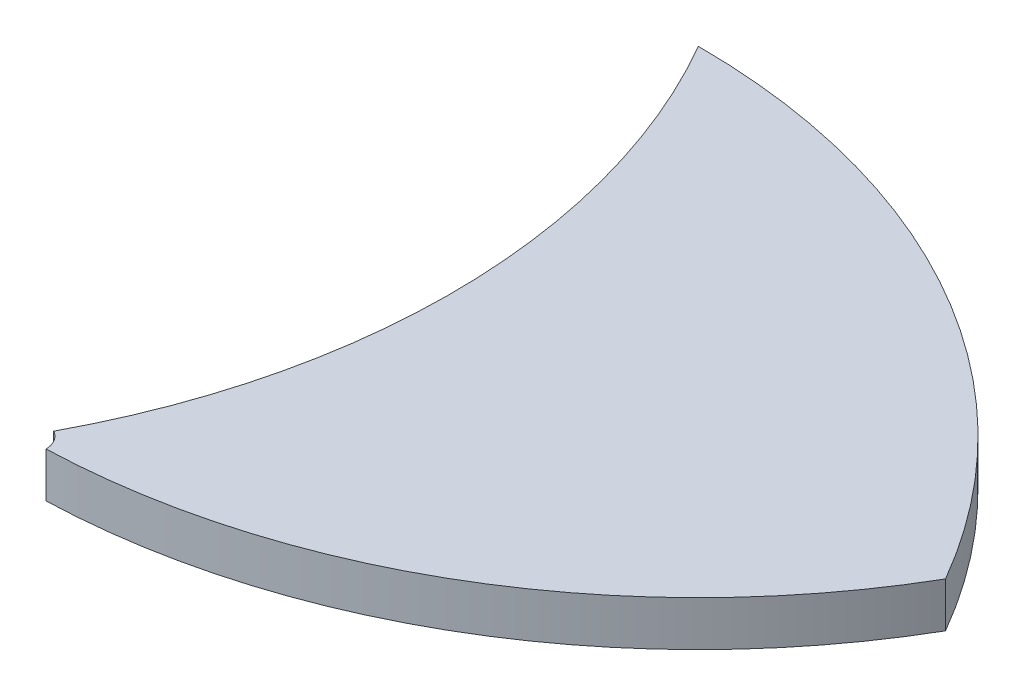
ISO-10303-21;
HEADER;
FILE_DESCRIPTION(('STEP AP214'),'2;1');
FILE_NAME('part.step','',(''),(''),'','','');
FILE_SCHEMA(('AUTOMOTIVE_DESIGN { 1 0 10303 214 1 1 1 1 }'));
ENDSEC;
DATA;
#1=APPLICATION_CONTEXT('core data for automotive mechanical design processes');
#2=APPLICATION_PROTOCOL_DEFINITION('international standard','automotive_design',2000,#1);
#3=PRODUCT_CONTEXT('',#1,'mechanical');
#4=PRODUCT('Part','Part','',(#3));
#5=PRODUCT_RELATED_PRODUCT_CATEGORY('part','',(#4));
#6=PRODUCT_DEFINITION_FORMATION('','',#4);
#7=PRODUCT_DEFINITION_CONTEXT('part definition',#1,'design');
#8=PRODUCT_DEFINITION('design','',#6,#7);
#9=PRODUCT_DEFINITION_SHAPE('','',#8);
#10=(LENGTH_UNIT() NAMED_UNIT(*) SI_UNIT(.MILLI.,.METRE.));
#11=(NAMED_UNIT(*) PLANE_ANGLE_UNIT() SI_UNIT($,.RADIAN.));
#12=(NAMED_UNIT(*) SI_UNIT($,.STERADIAN.) SOLID_ANGLE_UNIT());
#13=UNCERTAINTY_MEASURE_WITH_UNIT(LENGTH_MEASURE(1.E-05),#10,'distance_accuracy_value','');
#14=(GEOMETRIC_REPRESENTATION_CONTEXT(3) GLOBAL_UNCERTAINTY_ASSIGNED_CONTEXT((#13)) GLOBAL_UNIT_ASSIGNED_CONTEXT((#10,
#11,#12)) REPRESENTATION_CONTEXT('',''));
#15=CARTESIAN_POINT('',(0.,0.,0.));
#16=DIRECTION('',(0.,0.,1.));
#17=DIRECTION('',(1.,0.,0.));
#18=AXIS2_PLACEMENT_3D('',#15,#16,#17);
#19=CARTESIAN_POINT('',(-25.9807621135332,4.,15.));
#20=DIRECTION('',(0.,-1.,0.));
#21=DIRECTION('',(0.,0.,-1.));
#22=AXIS2_PLACEMENT_3D('',#19,#20,#21);
#23=CYLINDRICAL_SURFACE('',#22,30.);
#24=CARTESIAN_POINT('',(-25.9807621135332,2.,15.));
#25=DIRECTION('',(0.,1.,0.));
#26=DIRECTION('',(0.,0.,1.));
#27=AXIS2_PLACEMENT_3D('',#24,#25,#26);
#28=CIRCLE('',#27,30.);
#29=CARTESIAN_POINT('',(0.485496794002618,2.,29.1257615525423));
#30=VERTEX_POINT('',#29);
#31=CARTESIAN_POINT('',(0.,2.,0.));
#32=VERTEX_POINT('',#31);
#33=EDGE_CURVE('E97',#30,#32,#28,.T.);
#34=ORIENTED_EDGE('',*,*,#33,.F.);
#35=DIRECTION('',(0.,-1.,0.));
#36=VECTOR('',#35,1.);
#37=CARTESIAN_POINT('',(0.485496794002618,4.,29.1257615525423));
#38=LINE('',#37,#36);
#39=CARTESIAN_POINT('',(0.485496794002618,4.,29.1257615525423));
#40=VERTEX_POINT('',#39);
#41=EDGE_CURVE('E11',#40,#30,#38,.T.);
#42=ORIENTED_EDGE('',*,*,#41,.F.);
#43=CARTESIAN_POINT('',(-25.9807621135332,4.,15.));
#44=DIRECTION('',(0.,1.,0.));
#45=DIRECTION('',(0.,0.,1.));
#46=AXIS2_PLACEMENT_3D('',#43,#44,#45);
#47=CIRCLE('',#46,30.);
#48=CARTESIAN_POINT('',(0.,4.,0.));
#49=VERTEX_POINT('',#48);
#50=EDGE_CURVE('E85',#40,#49,#47,.T.);
#51=ORIENTED_EDGE('',*,*,#50,.T.);
#52=DIRECTION('',(0.,-1.,0.));
#53=VECTOR('',#52,1.);
#54=CARTESIAN_POINT('',(0.,4.,0.));
#55=LINE('',#54,#53);
#56=EDGE_CURVE('E74',#49,#32,#55,.T.);
#57=ORIENTED_EDGE('',*,*,#56,.T.);
#58=EDGE_LOOP('',(#34,#42,#51,#57));
#59=FACE_BOUND('',#58,.T.);
#60=ADVANCED_FACE('F35',(#59),#23,.F.);
#61=CARTESIAN_POINT('',(0.,4.,30.));
#62=DIRECTION('',(0.,-1.,0.));
#63=DIRECTION('',(0.,0.,-1.));
#64=AXIS2_PLACEMENT_3D('',#61,#62,#63);
#65=CYLINDRICAL_SURFACE('',#64,1.);
#66=CARTESIAN_POINT('',(0.,2.,30.));
#67=DIRECTION('',(0.,1.,0.));
#68=DIRECTION('',(0.,0.,1.));
#69=AXIS2_PLACEMENT_3D('',#66,#67,#68);
#70=CIRCLE('',#69,1.);
#71=CARTESIAN_POINT('',(0.999861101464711,2.,29.9833333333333));
#72=VERTEX_POINT('',#71);
#73=EDGE_CURVE('E90',#30,#72,#70,.F.);
#74=ORIENTED_EDGE('',*,*,#73,.T.);
#75=DIRECTION('',(0.,-1.,0.));
#76=VECTOR('',#75,1.);
#77=CARTESIAN_POINT('',(0.999861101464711,4.,29.9833333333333));
#78=LINE('',#77,#76);
#79=CARTESIAN_POINT('',(0.999861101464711,4.,29.9833333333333));
#80=VERTEX_POINT('',#79);
#81=EDGE_CURVE('E43',#80,#72,#78,.T.);
#82=ORIENTED_EDGE('',*,*,#81,.F.);
#83=CARTESIAN_POINT('',(0.,4.,30.));
#84=DIRECTION('',(0.,1.,0.));
#85=DIRECTION('',(0.,0.,1.));
#86=AXIS2_PLACEMENT_3D('',#83,#84,#85);
#87=CIRCLE('',#86,1.);
#88=EDGE_CURVE('E80',#40,#80,#87,.F.);
#89=ORIENTED_EDGE('',*,*,#88,.F.);
#90=ORIENTED_EDGE('',*,*,#41,.T.);
#91=EDGE_LOOP('',(#74,#82,#89,#90));
#92=FACE_BOUND('',#91,.T.);
#93=ADVANCED_FACE('F88',(#92),#65,.F.);
#94=CARTESIAN_POINT('',(0.,4.,0.));
#95=DIRECTION('',(0.,-1.,0.));
#96=DIRECTION('',(0.,0.,-1.));
#97=AXIS2_PLACEMENT_3D('',#94,#95,#96);
#98=CYLINDRICAL_SURFACE('',#97,30.);
#99=CARTESIAN_POINT('',(0.,2.,0.));
#100=DIRECTION('',(0.,1.,0.));
#101=DIRECTION('',(0.,0.,1.));
#102=AXIS2_PLACEMENT_3D('',#99,#100,#101);
#103=CIRCLE('',#102,30.);
#104=CARTESIAN_POINT('',(25.9807621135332,2.,15.));
#105=VERTEX_POINT('',#104);
#106=EDGE_CURVE('E67',#72,#105,#103,.T.);
#107=ORIENTED_EDGE('',*,*,#106,.T.);
#108=DIRECTION('',(0.,-1.,0.));
#109=VECTOR('',#108,1.);
#110=CARTESIAN_POINT('',(25.9807621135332,4.,15.));
#111=LINE('',#110,#109);
#112=CARTESIAN_POINT('',(25.9807621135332,4.,15.));
#113=VERTEX_POINT('',#112);
#114=EDGE_CURVE('E91',#113,#105,#111,.T.);
#115=ORIENTED_EDGE('',*,*,#114,.F.);
#116=CARTESIAN_POINT('',(0.,4.,0.));
#117=DIRECTION('',(0.,1.,0.));
#118=DIRECTION('',(0.,0.,1.));
#119=AXIS2_PLACEMENT_3D('',#116,#117,#118);
#120=CIRCLE('',#119,30.);
#121=EDGE_CURVE('E84',#80,#113,#120,.T.);
#122=ORIENTED_EDGE('',*,*,#121,.F.);
#123=ORIENTED_EDGE('',*,*,#81,.T.);
#124=EDGE_LOOP('',(#107,#115,#122,#123));
#125=FACE_BOUND('',#124,.T.);
#126=ADVANCED_FACE('F92',(#125),#98,.T.);
#127=CARTESIAN_POINT('',(0.,4.,30.));
#128=DIRECTION('',(0.,-1.,0.));
#129=DIRECTION('',(0.,0.,-1.));
#130=AXIS2_PLACEMENT_3D('',#127,#128,#129);
#131=CYLINDRICAL_SURFACE('',#130,30.);
#132=CARTESIAN_POINT('',(0.,2.,30.));
#133=DIRECTION('',(0.,1.,0.));
#134=DIRECTION('',(0.,0.,1.));
#135=AXIS2_PLACEMENT_3D('',#132,#133,#134);
#136=CIRCLE('',#135,30.);
#137=EDGE_CURVE('E102',#105,#32,#136,.T.);
#138=ORIENTED_EDGE('',*,*,#137,.T.);
#139=ORIENTED_EDGE('',*,*,#56,.F.);
#140=CARTESIAN_POINT('',(0.,4.,30.));
#141=DIRECTION('',(0.,1.,0.));
#142=DIRECTION('',(0.,0.,1.));
#143=AXIS2_PLACEMENT_3D('',#140,#141,#142);
#144=CIRCLE('',#143,30.);
#145=EDGE_CURVE('E51',#113,#49,#144,.T.);
#146=ORIENTED_EDGE('',*,*,#145,.F.);
#147=ORIENTED_EDGE('',*,*,#114,.T.);
#148=EDGE_LOOP('',(#138,#139,#146,#147));
#149=FACE_BOUND('',#148,.T.);
#150=ADVANCED_FACE('F107',(#149),#131,.T.);
#151=CARTESIAN_POINT('',(0.,4.,0.));
#152=DIRECTION('',(0.,1.,0.));
#153=DIRECTION('',(0.,0.,1.));
#154=AXIS2_PLACEMENT_3D('',#151,#152,#153);
#155=PLANE('',#154);
#156=ORIENTED_EDGE('',*,*,#50,.F.);
#157=ORIENTED_EDGE('',*,*,#88,.T.);
#158=ORIENTED_EDGE('',*,*,#121,.T.);
#159=ORIENTED_EDGE('',*,*,#145,.T.);
#160=EDGE_LOOP('',(#156,#157,#158,#159));
#161=FACE_BOUND('',#160,.T.);
#162=ADVANCED_FACE('F82',(#161),#155,.T.);
#163=CARTESIAN_POINT('',(0.,2.,0.));
#164=DIRECTION('',(0.,1.,0.));
#165=DIRECTION('',(0.,0.,1.));
#166=AXIS2_PLACEMENT_3D('',#163,#164,#165);
#167=PLANE('',#166);
#168=ORIENTED_EDGE('',*,*,#33,.T.);
#169=ORIENTED_EDGE('',*,*,#137,.F.);
#170=ORIENTED_EDGE('',*,*,#106,.F.);
#171=ORIENTED_EDGE('',*,*,#73,.F.);
#172=EDGE_LOOP('',(#168,#169,#170,#171));
#173=FACE_BOUND('',#172,.T.);
#174=ADVANCED_FACE('F109',(#173),#167,.F.);
#175=CLOSED_SHELL('',(#60,#93,#126,#150,#162,#174));
#176=MANIFOLD_SOLID_BREP('B2',#175);
#177=ADVANCED_BREP_SHAPE_REPRESENTATION('',(#18,#176),#14);
#178=SHAPE_DEFINITION_REPRESENTATION(#9,#177);
ENDSEC;
END-ISO-10303-21;
